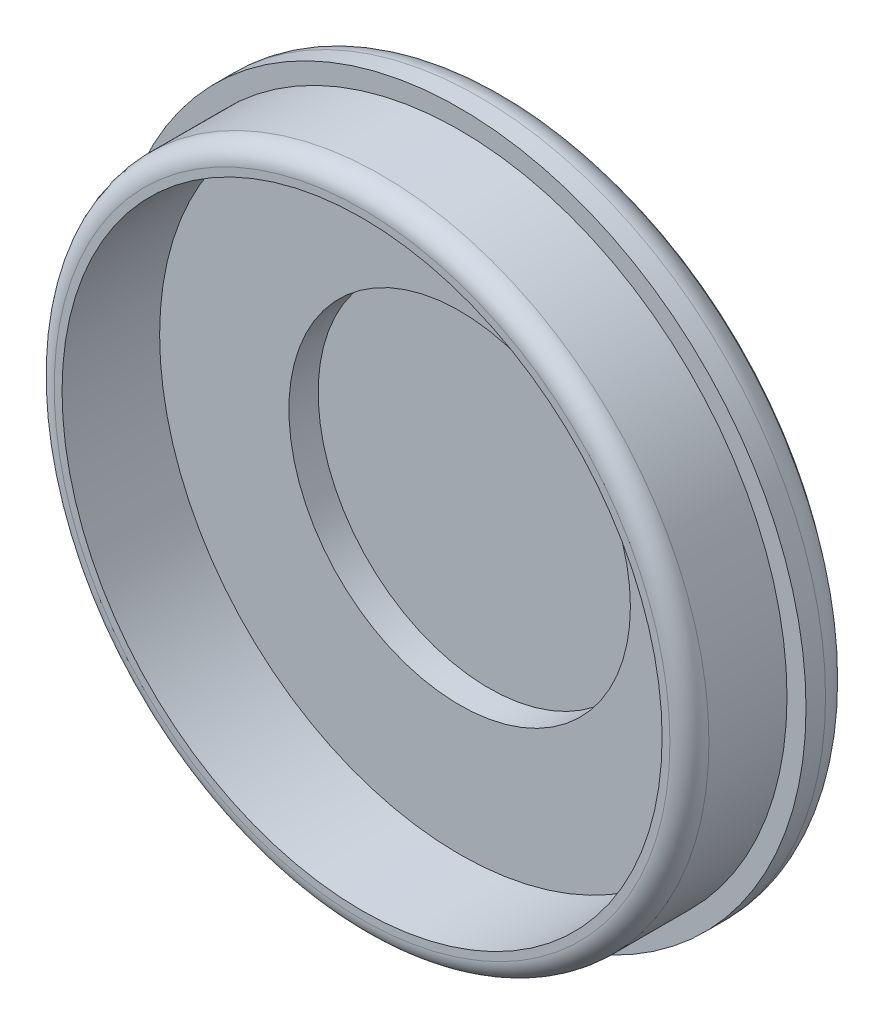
from build123d import *

# Parameters (mm, degrees)
SKETCH1_R           = 35.5
BOSS_EXTRUDE1_DEPTH = 5
FILLET1_R           = 3
SKETCH2_R           = 33.55
SKETCH2_R_2         = 30.75
BOSS_EXTRUDE2_DEPTH = 15
FILLET2_R           = 2
SKETCH3_R           = 31.55
BOSS_EXTRUDE3_DEPTH = 5
HOLE1_D             = 35
HOLE1_DEPTH         = 3


with BuildPart() as part:
    # Sketch1 → Boss-Extrude1 (new body)
    with BuildSketch(Plane.XY):
        Circle(SKETCH1_R)
    extrude(amount=BOSS_EXTRUDE1_DEPTH)

    # Fillet1
    fillet1_edges = [part.edges().sort_by_distance(p)[0] for p in [
        (-35.5, 0, 0),
    ]]
    fillet(fillet1_edges, radius=FILLET1_R)

    # Sketch2 → Boss-Extrude2 (add)
    with BuildSketch(Plane.XY):
        Circle(SKETCH2_R)
        Circle(SKETCH2_R_2, mode=Mode.SUBTRACT)
    extrude(amount=BOSS_EXTRUDE2_DEPTH)

    # Fillet2
    fillet2_edges = [part.edges().sort_by_distance(p)[0] for p in [
        (-33.55, 0, 15),
    ]]
    fillet(fillet2_edges, radius=FILLET2_R)

    # Sketch3 → Boss-Extrude3 (add)
    with BuildSketch(Plane.XY):
        Circle(SKETCH3_R)
    extrude(amount=BOSS_EXTRUDE3_DEPTH)

    # Hole1
    with Locations(Plane.XY.offset(5)):
        with Locations((0, 0)):
            Hole(HOLE1_D / 2, depth=HOLE1_DEPTH)


solid = part.part
